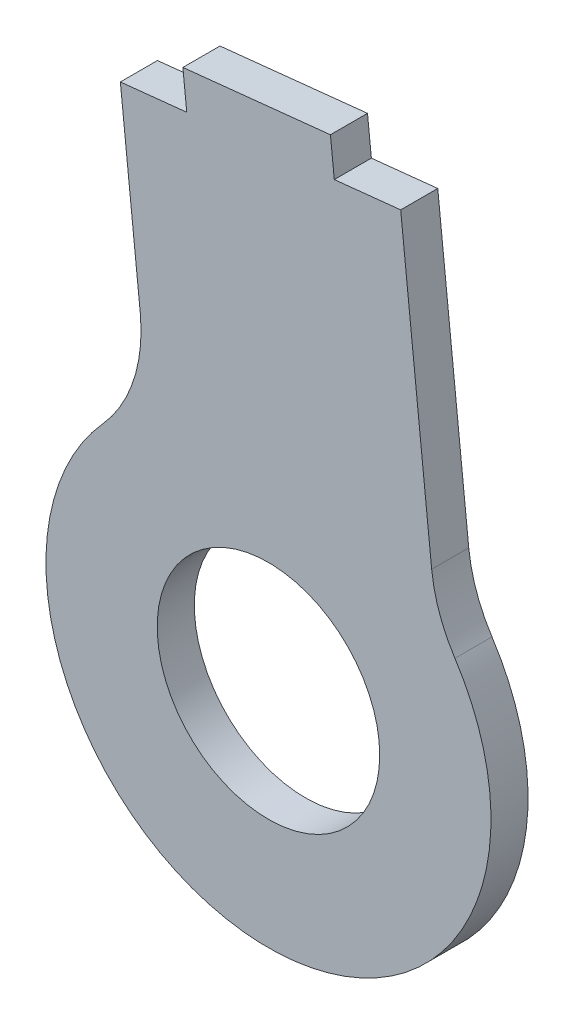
from build123d import *

# Parameters (mm, degrees)
SKETCH1_R           = 7.5
BOSS_EXTRUDE1_DEPTH = 2.5


with BuildPart() as part:
    # Sketch1 → Boss-Extrude1 (new body)
    with BuildSketch(Plane.XY):
        with BuildLine():
            Line((26.176632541, 34.555300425), (26.437198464, 32.068916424))
            Line((26.437198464, 32.068916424), (30.912689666, 32.537935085))
            Line((30.912689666, 32.537935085), (33.001743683, 12.603668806))
            ThreePointArc((33.001743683, 12.603668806), (33.522745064, 10.302558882), (34.568367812, 8.187559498))
            ThreePointArc((34.568367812, 8.187559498), (20.838083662, -14.954930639), (10.847081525, 10.030573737))
            ThreePointArc((10.847081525, 10.030573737), (12.922783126, 13.62873178), (13.357338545, 17.759886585))
            Line((13.357338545, 17.759886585), (12.016171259, 30.557634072))
            Line((12.016171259, 30.557634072), (16.49166246, 31.026652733))
            Line((16.49166246, 31.026652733), (16.231096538, 33.513036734))
            Line((16.231096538, 33.513036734), (26.176632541, 34.555300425))
        make_face()
        with Locations((22, 0)):
            Circle(SKETCH1_R, mode=Mode.SUBTRACT)
    extrude(amount=BOSS_EXTRUDE1_DEPTH)


solid = part.part
